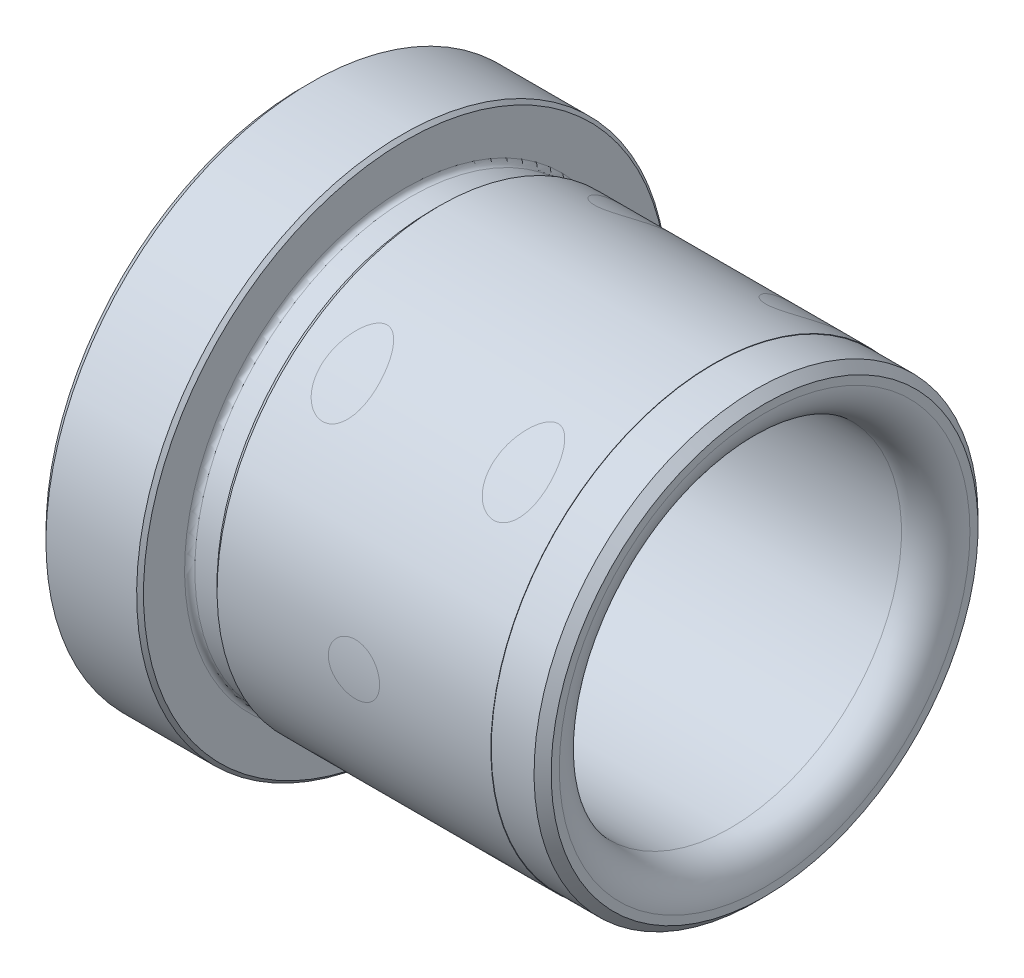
from build123d import *

# Parameters (mm, degrees)
SKETCH2_R      = 10
EXTRUDE1_DEPTH = 56
FILLET2_R      = 2
CHAMFER5_SIZE  = 0.2
CHAMFER3_SIZE  = 0.5
CHAMFER4_SIZE  = 0.5
CHAMFER7_SIZE  = 0.5


with BuildPart() as part:
    # Sketch1 → Revolve1 (revolve)
    with BuildSketch(Plane.XY):
        with BuildLine():
            Line((13.5, 12.975), (10.5, 12.975))
            Line((10.5, 12.975), (10.5, 13))
            Line((10.5, 13), (-5.5, 13))
            Line((-5.5, 13), (-5.9, 12.6))
            Line((-5.9, 12.6), (-7.2, 12.6))
            ThreePointArc((-7.2, 12.6), (-7.412132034, 12.687867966), (-7.5, 12.9))
            Line((-7.5, 12.9), (-7.5, 15.5))
            Line((-7.5, 15.5), (-13.5, 15.5))
            Line((-13.5, 15.5), (-13.5, 0))
            Line((-13.5, 0), (13.5, 0))
            Line((13.5, 0), (13.5, 12.975))
        make_face()
    revolve(axis=Axis((13.5, 0, 0), (-1, 0, 0)))

    # Sketch2 → Extrude1 (cut)
    with BuildSketch(Plane(origin=(13.5, 0, 0), x_dir=(0, 0, -1), z_dir=(1, 0, 0))):
        with Locations(Location((0, 0, 0), (0, 0, 90))):
            Circle(SKETCH2_R)
    extrude(amount=-EXTRUDE1_DEPTH, mode=Mode.SUBTRACT)

    # Fillet2
    fillet2_edges = [part.edges().sort_by_distance(p)[0] for p in [
        (13.5, -10, 0),
    ]]
    fillet(fillet2_edges, radius=FILLET2_R)

    # Chamfer5
    chamfer5_edges = [part.edges().sort_by_distance(p)[0] for p in [
        (-7.5, -15.5, 0),
    ]]
    chamfer(chamfer5_edges, length=CHAMFER5_SIZE)

    # Chamfer3
    chamfer3_edges = [part.edges().sort_by_distance(p)[0] for p in [
        (13.5, -12.975, 0),
    ]]
    chamfer(chamfer3_edges, length=CHAMFER3_SIZE)

    # Chamfer4
    chamfer4_edges = [part.edges().sort_by_distance(p)[0] for p in [
        (-13.5, -15.5, 0),
    ]]
    chamfer(chamfer4_edges, length=CHAMFER4_SIZE)

    # Chamfer7
    chamfer7_edges = [part.edges().sort_by_distance(p)[0] for p in [
        (-13.5, -10, 0),
    ]]
    chamfer(chamfer7_edges, length=CHAMFER7_SIZE)


solid = part.part
